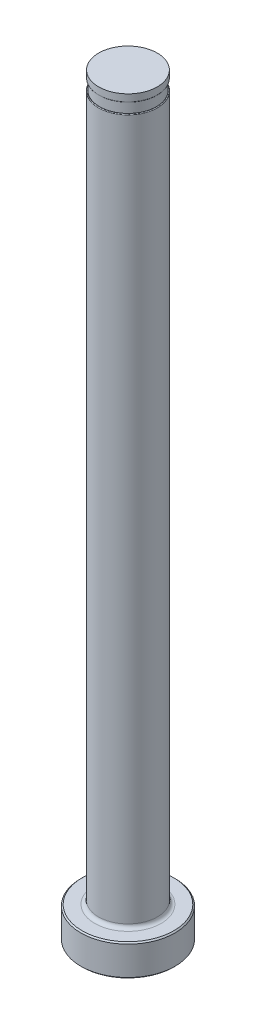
ISO-10303-21;
HEADER;
FILE_DESCRIPTION(('STEP AP214'),'2;1');
FILE_NAME('part.step','',(''),(''),'','','');
FILE_SCHEMA(('AUTOMOTIVE_DESIGN { 1 0 10303 214 1 1 1 1 }'));
ENDSEC;
DATA;
#1=APPLICATION_CONTEXT('core data for automotive mechanical design processes');
#2=APPLICATION_PROTOCOL_DEFINITION('international standard','automotive_design',2000,#1);
#3=PRODUCT_CONTEXT('',#1,'mechanical');
#4=PRODUCT('Part','Part','',(#3));
#5=PRODUCT_RELATED_PRODUCT_CATEGORY('part','',(#4));
#6=PRODUCT_DEFINITION_FORMATION('','',#4);
#7=PRODUCT_DEFINITION_CONTEXT('part definition',#1,'design');
#8=PRODUCT_DEFINITION('design','',#6,#7);
#9=PRODUCT_DEFINITION_SHAPE('','',#8);
#10=(LENGTH_UNIT() NAMED_UNIT(*) SI_UNIT(.MILLI.,.METRE.));
#11=(NAMED_UNIT(*) PLANE_ANGLE_UNIT() SI_UNIT($,.RADIAN.));
#12=(NAMED_UNIT(*) SI_UNIT($,.STERADIAN.) SOLID_ANGLE_UNIT());
#13=UNCERTAINTY_MEASURE_WITH_UNIT(LENGTH_MEASURE(1.E-05),#10,'distance_accuracy_value','');
#14=(GEOMETRIC_REPRESENTATION_CONTEXT(3) GLOBAL_UNCERTAINTY_ASSIGNED_CONTEXT((#13)) GLOBAL_UNIT_ASSIGNED_CONTEXT((#10,
#11,#12)) REPRESENTATION_CONTEXT('',''));
#15=CARTESIAN_POINT('',(0.,0.,0.));
#16=DIRECTION('',(0.,0.,1.));
#17=DIRECTION('',(1.,0.,0.));
#18=AXIS2_PLACEMENT_3D('',#15,#16,#17);
#19=CARTESIAN_POINT('',(-5.95248999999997,150.876,0.));
#20=DIRECTION('',(0.,1.,0.));
#21=DIRECTION('',(0.,0.,1.));
#22=AXIS2_PLACEMENT_3D('',#19,#20,#21);
#23=PLANE('',#22);
#24=CARTESIAN_POINT('',(0.,150.876,0.));
#25=DIRECTION('',(0.,1.,0.));
#26=DIRECTION('',(0.,0.,1.));
#27=AXIS2_PLACEMENT_3D('',#24,#25,#26);
#28=CIRCLE('',#27,5.80008999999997);
#29=CARTESIAN_POINT('',(0.,150.876,5.80008999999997));
#30=VERTEX_POINT('',#29);
#31=EDGE_CURVE('E11',#30,#30,#28,.F.);
#32=ORIENTED_EDGE('',*,*,#31,.T.);
#33=EDGE_LOOP('',(#32));
#34=FACE_BOUND('',#33,.T.);
#35=CARTESIAN_POINT('',(0.,150.876,0.));
#36=DIRECTION('',(0.,1.,0.));
#37=DIRECTION('',(0.,0.,1.));
#38=AXIS2_PLACEMENT_3D('',#35,#36,#37);
#39=CIRCLE('',#38,5.74928999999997);
#40=CARTESIAN_POINT('',(0.,150.876,5.74928999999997));
#41=VERTEX_POINT('',#40);
#42=EDGE_CURVE('E79',#41,#41,#39,.T.);
#43=ORIENTED_EDGE('',*,*,#42,.T.);
#44=EDGE_LOOP('',(#43));
#45=FACE_BOUND('',#44,.T.);
#46=ADVANCED_FACE('F37',(#34,#45),#23,.F.);
#47=CARTESIAN_POINT('',(0.,259.958771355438,0.));
#48=DIRECTION('',(0.,1.,0.));
#49=DIRECTION('',(0.,0.,1.));
#50=AXIS2_PLACEMENT_3D('',#47,#48,#49);
#51=CYLINDRICAL_SURFACE('',#50,5.95248999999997);
#52=DIRECTION('',(0.,1.,0.));
#53=VECTOR('',#52,1.);
#54=CARTESIAN_POINT('',(-5.74928999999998,259.958771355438,-1.5420122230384));
#55=LINE('',#54,#53);
#56=CARTESIAN_POINT('',(-5.74928999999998,148.717,-1.5420122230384));
#57=VERTEX_POINT('',#56);
#58=CARTESIAN_POINT('',(-5.74928999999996,86.36,-1.54201222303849));
#59=VERTEX_POINT('',#58);
#60=EDGE_CURVE('E74',#57,#59,#55,.F.);
#61=ORIENTED_EDGE('',*,*,#60,.F.);
#62=CARTESIAN_POINT('',(0.,148.717,0.));
#63=DIRECTION('',(0.,-1.,0.));
#64=DIRECTION('',(0.,0.,-1.));
#65=AXIS2_PLACEMENT_3D('',#62,#63,#64);
#66=CIRCLE('',#65,5.95248999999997);
#67=CARTESIAN_POINT('',(-5.74928999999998,148.717,1.5420122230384));
#68=VERTEX_POINT('',#67);
#69=EDGE_CURVE('E52',#57,#68,#66,.T.);
#70=ORIENTED_EDGE('',*,*,#69,.T.);
#71=DIRECTION('',(0.,1.,0.));
#72=VECTOR('',#71,1.);
#73=CARTESIAN_POINT('',(-5.74928999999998,259.958771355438,1.5420122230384));
#74=LINE('',#73,#72);
#75=CARTESIAN_POINT('',(-5.74928999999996,86.36,1.54201222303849));
#76=VERTEX_POINT('',#75);
#77=EDGE_CURVE('E85',#76,#68,#74,.T.);
#78=ORIENTED_EDGE('',*,*,#77,.F.);
#79=CARTESIAN_POINT('',(-5.74928999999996,86.36,-1.54201222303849));
#80=CARTESIAN_POINT('',(-5.7492869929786,86.3322208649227,-1.54201697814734));
#81=CARTESIAN_POINT('',(-5.74965505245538,86.3044610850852,-1.54065166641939));
#82=CARTESIAN_POINT('',(-5.75110274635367,86.2492460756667,-1.53524151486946));
#83=CARTESIAN_POINT('',(-5.75218176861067,86.2217906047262,-1.53119898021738));
#84=CARTESIAN_POINT('',(-5.75641075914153,86.1407767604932,-1.51525486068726));
#85=CARTESIAN_POINT('',(-5.76055400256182,86.0879793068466,-1.49953379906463));
#86=CARTESIAN_POINT('',(-5.77092696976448,85.9864513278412,-1.45909687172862));
#87=CARTESIAN_POINT('',(-5.77715061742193,85.937709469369,-1.43440718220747));
#88=CARTESIAN_POINT('',(-5.79098788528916,85.8449780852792,-1.37748193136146));
#89=CARTESIAN_POINT('',(-5.7986047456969,85.8010000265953,-1.34522872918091));
#90=CARTESIAN_POINT('',(-5.81685908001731,85.7061849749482,-1.26430278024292));
#91=CARTESIAN_POINT('',(-5.82772577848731,85.657138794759,-1.21359133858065));
#92=CARTESIAN_POINT('',(-5.84932001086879,85.5679814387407,-1.10484574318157));
#93=CARTESIAN_POINT('',(-5.86004729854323,85.5278844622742,-1.04680017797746));
#94=CARTESIAN_POINT('',(-5.88390059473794,85.4439339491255,-0.904778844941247));
#95=CARTESIAN_POINT('',(-5.89659263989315,85.4034837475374,-0.818723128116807));
#96=CARTESIAN_POINT('',(-5.91855552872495,85.3365666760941,-0.641010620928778));
#97=CARTESIAN_POINT('',(-5.92782357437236,85.3101112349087,-0.549349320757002));
#98=CARTESIAN_POINT('',(-5.94230780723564,85.2696429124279,-0.360889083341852));
#99=CARTESIAN_POINT('',(-5.94742894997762,85.2559208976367,-0.2640211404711));
#100=CARTESIAN_POINT('',(-5.95288793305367,85.241318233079,-0.0691558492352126));
#101=CARTESIAN_POINT('',(-5.95322242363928,85.2404465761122,0.0288422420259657));
#102=CARTESIAN_POINT('',(-5.94868446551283,85.2525404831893,0.242237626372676));
#103=CARTESIAN_POINT('',(-5.94283113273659,85.2681121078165,0.357477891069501));
#104=CARTESIAN_POINT('',(-5.92492015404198,85.3183022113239,0.583281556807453));
#105=CARTESIAN_POINT('',(-5.91286985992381,85.3528981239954,0.69385033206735));
#106=CARTESIAN_POINT('',(-5.88892429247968,85.4282489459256,0.870563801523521));
#107=CARTESIAN_POINT('',(-5.87828331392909,85.4632292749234,0.939352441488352));
#108=CARTESIAN_POINT('',(-5.85581507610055,85.5434071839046,1.07049428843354));
#109=CARTESIAN_POINT('',(-5.8439898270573,85.5885876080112,1.13285804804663));
#110=CARTESIAN_POINT('',(-5.82307219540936,85.6783208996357,1.2353431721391));
#111=CARTESIAN_POINT('',(-5.81396107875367,85.7207467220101,1.27731748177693));
#112=CARTESIAN_POINT('',(-5.79660025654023,85.8119777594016,1.35392068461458));
#113=CARTESIAN_POINT('',(-5.78834968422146,85.8607764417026,1.38855700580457));
#114=CARTESIAN_POINT('',(-5.77487399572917,85.9554137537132,1.44347959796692));
#115=CARTESIAN_POINT('',(-5.76937362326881,86.0003804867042,1.46519744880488));
#116=CARTESIAN_POINT('',(-5.76015985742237,86.0933997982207,1.50101335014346));
#117=CARTESIAN_POINT('',(-5.75644319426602,86.1414465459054,1.51512534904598));
#118=CARTESIAN_POINT('',(-5.75233279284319,86.2182424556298,1.53063311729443));
#119=CARTESIAN_POINT('',(-5.75119737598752,86.246400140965,1.53488770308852));
#120=CARTESIAN_POINT('',(-5.74967384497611,86.3030323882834,1.54058135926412));
#121=CARTESIAN_POINT('',(-5.74928611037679,86.3315071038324,1.54201899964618));
#122=CARTESIAN_POINT('',(-5.74928999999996,86.36,1.54201222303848));
#123=B_SPLINE_CURVE_WITH_KNOTS('',3,(#79,#80,#81,#82,#83,#84,#85,#86,#87,#88,#89,#90,#91,#92,
#93,#94,#95,#96,#97,#98,#99,#100,#101,#102,#103,#104,#105,#106,#107,#108,#109,#110,#111,#112,
#113,#114,#115,#116,#117,#118,#119,#120,#121,#122),.UNSPECIFIED.,.F.,.F.,(4,2,2,2,2,2,2,2,2,2,2,
2,2,2,2,2,2,2,2,2,2,4),(0.,0.083264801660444,0.166458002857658,0.331100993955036,
0.495267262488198,0.659820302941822,0.872804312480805,1.08612389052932,1.37238232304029,
1.65887416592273,1.95175985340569,2.24485049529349,2.59250114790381,2.939740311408,
3.17269488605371,3.40526052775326,3.58572381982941,3.7660035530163,3.91610532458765,
4.06593087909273,4.15129340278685,4.23669924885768),.UNSPECIFIED.);
#124=EDGE_CURVE('E82',#59,#76,#123,.T.);
#125=ORIENTED_EDGE('',*,*,#124,.F.);
#126=EDGE_LOOP('',(#61,#70,#78,#125));
#127=FACE_BOUND('',#126,.T.);
#128=CARTESIAN_POINT('',(0.,7.11200000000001,0.));
#129=DIRECTION('',(0.,1.,0.));
#130=DIRECTION('',(0.,0.,1.));
#131=AXIS2_PLACEMENT_3D('',#128,#129,#130);
#132=CIRCLE('',#131,5.95248999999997);
#133=CARTESIAN_POINT('',(0.,7.11200000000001,5.95248999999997));
#134=VERTEX_POINT('',#133);
#135=EDGE_CURVE('E117',#134,#134,#132,.T.);
#136=ORIENTED_EDGE('',*,*,#135,.T.);
#137=EDGE_LOOP('',(#136));
#138=FACE_BOUND('',#137,.T.);
#139=ADVANCED_FACE('F83',(#127,#138),#51,.T.);
#140=CARTESIAN_POINT('',(0.,0.,0.));
#141=DIRECTION('',(0.,-1.,0.));
#142=DIRECTION('',(0.,0.,-1.));
#143=AXIS2_PLACEMENT_3D('',#140,#141,#142);
#144=PLANE('',#143);
#145=CARTESIAN_POINT('',(0.,0.,0.));
#146=DIRECTION('',(0.,-1.,0.));
#147=DIRECTION('',(0.,0.,-1.));
#148=AXIS2_PLACEMENT_3D('',#145,#146,#147);
#149=CIRCLE('',#148,9.271);
#150=CARTESIAN_POINT('',(0.,0.,-9.271));
#151=VERTEX_POINT('',#150);
#152=EDGE_CURVE('E114',#151,#151,#149,.T.);
#153=ORIENTED_EDGE('',*,*,#152,.T.);
#154=EDGE_LOOP('',(#153));
#155=FACE_BOUND('',#154,.T.);
#156=ADVANCED_FACE('F193',(#155),#144,.T.);
#157=CARTESIAN_POINT('',(0.,259.958771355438,0.));
#158=DIRECTION('',(0.,1.,0.));
#159=DIRECTION('',(0.,0.,1.));
#160=AXIS2_PLACEMENT_3D('',#157,#158,#159);
#161=CYLINDRICAL_SURFACE('',#160,9.52499999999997);
#162=CARTESIAN_POINT('',(0.,6.09600000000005,0.));
#163=DIRECTION('',(0.,1.,0.));
#164=DIRECTION('',(0.,0.,1.));
#165=AXIS2_PLACEMENT_3D('',#162,#163,#164);
#166=CIRCLE('',#165,9.52499999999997);
#167=CARTESIAN_POINT('',(0.,6.09600000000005,9.52499999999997));
#168=VERTEX_POINT('',#167);
#169=EDGE_CURVE('E111',#168,#168,#166,.F.);
#170=ORIENTED_EDGE('',*,*,#169,.T.);
#171=EDGE_LOOP('',(#170));
#172=FACE_BOUND('',#171,.T.);
#173=CARTESIAN_POINT('',(0.,0.253999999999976,0.));
#174=DIRECTION('',(0.,-1.,0.));
#175=DIRECTION('',(0.,0.,-1.));
#176=AXIS2_PLACEMENT_3D('',#173,#174,#175);
#177=CIRCLE('',#176,9.52499999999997);
#178=CARTESIAN_POINT('',(0.,0.253999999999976,-9.52499999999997));
#179=VERTEX_POINT('',#178);
#180=EDGE_CURVE('E108',#179,#179,#177,.F.);
#181=ORIENTED_EDGE('',*,*,#180,.T.);
#182=EDGE_LOOP('',(#181));
#183=FACE_BOUND('',#182,.T.);
#184=ADVANCED_FACE('F196',(#172,#183),#161,.T.);
#185=CARTESIAN_POINT('',(-9.52499999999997,6.35,0.));
#186=DIRECTION('',(0.,1.,0.));
#187=DIRECTION('',(0.,0.,1.));
#188=AXIS2_PLACEMENT_3D('',#185,#186,#187);
#189=PLANE('',#188);
#190=CARTESIAN_POINT('',(0.,6.35,0.));
#191=DIRECTION('',(0.,1.,0.));
#192=DIRECTION('',(0.,0.,1.));
#193=AXIS2_PLACEMENT_3D('',#190,#191,#192);
#194=CIRCLE('',#193,6.71448999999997);
#195=CARTESIAN_POINT('',(0.,6.35,6.71448999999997));
#196=VERTEX_POINT('',#195);
#197=EDGE_CURVE('E88',#196,#196,#194,.F.);
#198=ORIENTED_EDGE('',*,*,#197,.T.);
#199=EDGE_LOOP('',(#198));
#200=FACE_BOUND('',#199,.T.);
#201=CARTESIAN_POINT('',(0.,6.35,0.));
#202=DIRECTION('',(0.,1.,0.));
#203=DIRECTION('',(0.,0.,1.));
#204=AXIS2_PLACEMENT_3D('',#201,#202,#203);
#205=CIRCLE('',#204,9.27100000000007);
#206=CARTESIAN_POINT('',(0.,6.35,9.27100000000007));
#207=VERTEX_POINT('',#206);
#208=EDGE_CURVE('E105',#207,#207,#205,.T.);
#209=ORIENTED_EDGE('',*,*,#208,.T.);
#210=EDGE_LOOP('',(#209));
#211=FACE_BOUND('',#210,.T.);
#212=ADVANCED_FACE('F191',(#200,#211),#189,.T.);
#213=CARTESIAN_POINT('',(0.,6.35000000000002,0.));
#214=DIRECTION('',(0.,-1.,0.));
#215=DIRECTION('',(0.,0.,-1.));
#216=AXIS2_PLACEMENT_3D('',#213,#214,#215);
#217=CONICAL_SURFACE('',#216,9.27100000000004,0.785398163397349);
#218=ORIENTED_EDGE('',*,*,#169,.F.);
#219=EDGE_LOOP('',(#218));
#220=FACE_BOUND('',#219,.T.);
#221=ORIENTED_EDGE('',*,*,#208,.F.);
#222=EDGE_LOOP('',(#221));
#223=FACE_BOUND('',#222,.T.);
#224=ADVANCED_FACE('F187',(#220,#223),#217,.T.);
#225=CARTESIAN_POINT('',(0.,0.253999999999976,0.));
#226=DIRECTION('',(0.,1.,0.));
#227=DIRECTION('',(0.,0.,1.));
#228=AXIS2_PLACEMENT_3D('',#225,#226,#227);
#229=CONICAL_SURFACE('',#228,9.52499999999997,0.785398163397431);
#230=ORIENTED_EDGE('',*,*,#152,.F.);
#231=EDGE_LOOP('',(#230));
#232=FACE_BOUND('',#231,.T.);
#233=ORIENTED_EDGE('',*,*,#180,.F.);
#234=EDGE_LOOP('',(#233));
#235=FACE_BOUND('',#234,.T.);
#236=ADVANCED_FACE('F183',(#232,#235),#229,.T.);
#237=CARTESIAN_POINT('',(0.,7.11200000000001,0.));
#238=DIRECTION('',(0.,1.,0.));
#239=DIRECTION('',(0.,0.,1.));
#240=AXIS2_PLACEMENT_3D('',#237,#238,#239);
#241=TOROIDAL_SURFACE('',#240,6.71448999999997,0.762);
#242=ORIENTED_EDGE('',*,*,#197,.F.);
#243=EDGE_LOOP('',(#242));
#244=FACE_BOUND('',#243,.T.);
#245=ORIENTED_EDGE('',*,*,#135,.F.);
#246=EDGE_LOOP('',(#245));
#247=FACE_BOUND('',#246,.T.);
#248=ADVANCED_FACE('F148',(#244,#247),#241,.F.);
#249=CARTESIAN_POINT('',(-5.95248999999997,148.844,0.));
#250=DIRECTION('',(0.,-1.,0.));
#251=DIRECTION('',(0.,0.,-1.));
#252=AXIS2_PLACEMENT_3D('',#249,#250,#251);
#253=PLANE('',#252);
#254=DIRECTION('',(0.,0.,1.));
#255=VECTOR('',#254,1.);
#256=CARTESIAN_POINT('',(-5.74928999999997,148.844,0.));
#257=LINE('',#256,#255);
#258=CARTESIAN_POINT('',(-5.74928999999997,148.844,0.));
#259=VERTEX_POINT('',#258);
#260=CARTESIAN_POINT('',(-5.74928999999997,148.844,0.939147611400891));
#261=VERTEX_POINT('',#260);
#262=EDGE_CURVE('E91',#259,#261,#257,.T.);
#263=ORIENTED_EDGE('',*,*,#262,.T.);
#264=CARTESIAN_POINT('',(0.,148.844,0.));
#265=DIRECTION('',(0.,-1.,0.));
#266=DIRECTION('',(0.,0.,-1.));
#267=AXIS2_PLACEMENT_3D('',#264,#265,#266);
#268=CIRCLE('',#267,5.82548999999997);
#269=CARTESIAN_POINT('',(-5.74928999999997,148.844,-0.939147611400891));
#270=VERTEX_POINT('',#269);
#271=EDGE_CURVE('E87',#261,#270,#268,.F.);
#272=ORIENTED_EDGE('',*,*,#271,.T.);
#273=EDGE_CURVE('E80',#270,#259,#257,.T.);
#274=ORIENTED_EDGE('',*,*,#273,.T.);
#275=CARTESIAN_POINT('',(0.,148.844,0.));
#276=DIRECTION('',(0.,1.,0.));
#277=DIRECTION('',(0.,0.,1.));
#278=AXIS2_PLACEMENT_3D('',#275,#276,#277);
#279=CIRCLE('',#278,5.74928999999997);
#280=EDGE_CURVE('E102',#259,#259,#279,.T.);
#281=ORIENTED_EDGE('',*,*,#280,.F.);
#282=EDGE_LOOP('',(#263,#272,#274,#281));
#283=FACE_BOUND('',#282,.T.);
#284=ADVANCED_FACE('F145',(#283),#253,.F.);
#285=CARTESIAN_POINT('',(0.,153.448281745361,0.));
#286=DIRECTION('',(0.,1.,0.));
#287=DIRECTION('',(0.,0.,1.));
#288=AXIS2_PLACEMENT_3D('',#285,#286,#287);
#289=CYLINDRICAL_SURFACE('',#288,5.74928999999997);
#290=ORIENTED_EDGE('',*,*,#42,.F.);
#291=EDGE_LOOP('',(#290));
#292=FACE_BOUND('',#291,.T.);
#293=ORIENTED_EDGE('',*,*,#280,.T.);
#294=EDGE_LOOP('',(#293));
#295=FACE_BOUND('',#294,.T.);
#296=ADVANCED_FACE('F142',(#292,#295),#289,.T.);
#297=CARTESIAN_POINT('',(-5.74928999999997,149.86,-9.52499999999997));
#298=DIRECTION('',(1.,0.,0.));
#299=DIRECTION('',(0.,1.,0.));
#300=AXIS2_PLACEMENT_3D('',#297,#298,#299);
#301=PLANE('',#300);
#302=ORIENTED_EDGE('',*,*,#273,.F.);
#303=CARTESIAN_POINT('',(-5.74928999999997,148.844,-0.939147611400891));
#304=CARTESIAN_POINT('',(-5.74928999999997,148.843999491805,-0.960313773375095));
#305=CARTESIAN_POINT('',(-5.74928999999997,148.843863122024,-0.981479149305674));
#306=CARTESIAN_POINT('',(-5.74928999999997,148.843255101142,-1.02381131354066));
#307=CARTESIAN_POINT('',(-5.74928999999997,148.842783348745,-1.0449781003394));
#308=CARTESIAN_POINT('',(-5.74928999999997,148.840768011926,-1.10851964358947));
#309=CARTESIAN_POINT('',(-5.74928999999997,148.838624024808,-1.15088175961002));
#310=CARTESIAN_POINT('',(-5.74928999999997,148.833688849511,-1.21286687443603));
#311=CARTESIAN_POINT('',(-5.74928999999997,148.831853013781,-1.23256518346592));
#312=CARTESIAN_POINT('',(-5.74928999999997,148.827501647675,-1.27188290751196));
#313=CARTESIAN_POINT('',(-5.74928999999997,148.824986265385,-1.2915023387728));
#314=CARTESIAN_POINT('',(-5.74928999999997,148.817966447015,-1.33801228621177));
#315=CARTESIAN_POINT('',(-5.74928999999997,148.813069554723,-1.36484781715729));
#316=CARTESIAN_POINT('',(-5.74928999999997,148.802495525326,-1.40986464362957));
#317=CARTESIAN_POINT('',(-5.74928999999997,148.797508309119,-1.42819643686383));
#318=CARTESIAN_POINT('',(-5.74928999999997,148.788514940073,-1.45484549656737));
#319=CARTESIAN_POINT('',(-5.74928999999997,148.785335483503,-1.46343850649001));
#320=CARTESIAN_POINT('',(-5.74928999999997,148.77827591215,-1.48034059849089));
#321=CARTESIAN_POINT('',(-5.74928999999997,148.774396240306,-1.48864985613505));
#322=CARTESIAN_POINT('',(-5.74928999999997,148.767506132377,-1.50120056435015));
#323=CARTESIAN_POINT('',(-5.74928999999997,148.764853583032,-1.50563682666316));
#324=CARTESIAN_POINT('',(-5.74928999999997,148.759101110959,-1.51421595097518));
#325=CARTESIAN_POINT('',(-5.74928999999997,148.75600162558,-1.51835909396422));
#326=CARTESIAN_POINT('',(-5.74928999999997,148.750471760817,-1.52466635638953));
#327=CARTESIAN_POINT('',(-5.74928999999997,148.74822570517,-1.52699040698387));
#328=CARTESIAN_POINT('',(-5.74928999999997,148.743445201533,-1.53132640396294));
#329=CARTESIAN_POINT('',(-5.74928999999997,148.740911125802,-1.53333874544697));
#330=CARTESIAN_POINT('',(-5.74928999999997,148.736334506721,-1.53634422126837));
#331=CARTESIAN_POINT('',(-5.74928999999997,148.734374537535,-1.53746164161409));
#332=CARTESIAN_POINT('',(-5.74928999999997,148.730307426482,-1.53937528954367));
#333=CARTESIAN_POINT('',(-5.74928999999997,148.728200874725,-1.54017272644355));
#334=CARTESIAN_POINT('',(-5.74928999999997,148.7245728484,-1.54117250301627));
#335=CARTESIAN_POINT('',(-5.74928999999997,148.723081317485,-1.54148377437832));
#336=CARTESIAN_POINT('',(-5.74928999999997,148.720060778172,-1.54190531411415));
#337=CARTESIAN_POINT('',(-5.74928999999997,148.718531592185,-1.54201429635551));
#338=CARTESIAN_POINT('',(-5.74928999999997,148.717000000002,-1.54201222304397));
#339=B_SPLINE_CURVE_WITH_KNOTS('',3,(#303,#304,#305,#306,#307,#308,#309,#310,#311,#312,#313,
#314,#315,#316,#317,#318,#319,#320,#321,#322,#323,#324,#325,#326,#327,#328,#329,#330,#331,#332,
#333,#334,#335,#336,#337,#338),.UNSPECIFIED.,.F.,.F.,(4,2,2,2,2,2,2,2,2,2,2,2,2,2,2,2,2,4),(0.,
0.0634959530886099,0.127011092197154,0.254202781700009,0.313544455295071,0.372873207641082,
0.45462942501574,0.511527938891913,0.538997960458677,0.566450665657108,0.581940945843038,
0.597416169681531,0.607094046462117,0.616759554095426,0.623507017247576,0.630228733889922,
0.634786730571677,0.639373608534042),.UNSPECIFIED.);
#340=EDGE_CURVE('E60',#270,#57,#339,.T.);
#341=ORIENTED_EDGE('',*,*,#340,.T.);
#342=ORIENTED_EDGE('',*,*,#60,.T.);
#343=DIRECTION('',(0.,0.,1.));
#344=VECTOR('',#343,1.);
#345=CARTESIAN_POINT('',(-5.74928999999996,86.36,-9.52499999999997));
#346=LINE('',#345,#344);
#347=EDGE_CURVE('E78',#59,#76,#346,.T.);
#348=ORIENTED_EDGE('',*,*,#347,.T.);
#349=ORIENTED_EDGE('',*,*,#77,.T.);
#350=CARTESIAN_POINT('',(-5.74928999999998,148.717,1.5420122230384));
#351=CARTESIAN_POINT('',(-5.74928999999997,148.719261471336,1.54202038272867));
#352=CARTESIAN_POINT('',(-5.74928999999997,148.721510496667,1.54177946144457));
#353=CARTESIAN_POINT('',(-5.74928999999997,148.725887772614,1.54087970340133));
#354=CARTESIAN_POINT('',(-5.74928999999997,148.728017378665,1.54022760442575));
#355=CARTESIAN_POINT('',(-5.74928999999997,148.732617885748,1.53838865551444));
#356=CARTESIAN_POINT('',(-5.74928999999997,148.735052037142,1.53711237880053));
#357=CARTESIAN_POINT('',(-5.74928999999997,148.739698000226,1.53418694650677));
#358=CARTESIAN_POINT('',(-5.74928999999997,148.741908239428,1.53253538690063));
#359=CARTESIAN_POINT('',(-5.74928999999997,148.747730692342,1.52761233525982));
#360=CARTESIAN_POINT('',(-5.74928999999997,148.751112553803,1.52407243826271));
#361=CARTESIAN_POINT('',(-5.74928999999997,148.757360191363,1.51657566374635));
#362=CARTESIAN_POINT('',(-5.74928999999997,148.76022496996,1.51261800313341));
#363=CARTESIAN_POINT('',(-5.74928999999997,148.767008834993,1.50226117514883));
#364=CARTESIAN_POINT('',(-5.74928999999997,148.770667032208,1.49569302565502));
#365=CARTESIAN_POINT('',(-5.74928999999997,148.777372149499,1.48224724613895));
#366=CARTESIAN_POINT('',(-5.74928999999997,148.780417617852,1.47536892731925));
#367=CARTESIAN_POINT('',(-5.74928999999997,148.788912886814,1.45440029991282));
#368=CARTESIAN_POINT('',(-5.74928999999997,148.793686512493,1.44003865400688));
#369=CARTESIAN_POINT('',(-5.74928999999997,148.802114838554,1.41106200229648));
#370=CARTESIAN_POINT('',(-5.74928999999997,148.805772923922,1.39644790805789));
#371=CARTESIAN_POINT('',(-5.74928999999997,148.812305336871,1.36704254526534));
#372=CARTESIAN_POINT('',(-5.74928999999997,148.815179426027,1.35225122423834));
#373=CARTESIAN_POINT('',(-5.74928999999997,148.822936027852,1.30765909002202));
#374=CARTESIAN_POINT('',(-5.74928999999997,148.826935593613,1.27770752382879));
#375=CARTESIAN_POINT('',(-5.74928999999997,148.833413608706,1.21764271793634));
#376=CARTESIAN_POINT('',(-5.74928999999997,148.835891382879,1.18752941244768));
#377=CARTESIAN_POINT('',(-5.74928999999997,148.83974393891,1.12726865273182));
#378=CARTESIAN_POINT('',(-5.74928999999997,148.841119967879,1.09712127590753));
#379=CARTESIAN_POINT('',(-5.74928999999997,148.842769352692,1.04562383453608));
#380=CARTESIAN_POINT('',(-5.74928999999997,148.843247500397,1.02427949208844));
#381=CARTESIAN_POINT('',(-5.74928999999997,148.843861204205,0.981672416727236));
#382=CARTESIAN_POINT('',(-5.74928999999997,148.843998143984,0.960409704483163));
#383=CARTESIAN_POINT('',(-5.74928999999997,148.844,0.939147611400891));
#384=B_SPLINE_CURVE_WITH_KNOTS('',3,(#350,#351,#352,#353,#354,#355,#356,#357,#358,#359,#360,
#361,#362,#363,#364,#365,#366,#367,#368,#369,#370,#371,#372,#373,#374,#375,#376,#377,#378,#379,
#380,#381,#382,#383),.UNSPECIFIED.,.F.,.F.,(4,2,2,2,2,2,2,2,2,2,2,2,2,2,2,2,4),(0.,
0.00675172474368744,0.0133955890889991,0.0215941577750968,0.0298468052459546,0.0444516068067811,
0.0590842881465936,0.0815815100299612,0.104131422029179,0.149443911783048,0.194617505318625,
0.239804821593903,0.330387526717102,0.421010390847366,0.511530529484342,0.575577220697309,
0.639363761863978),.UNSPECIFIED.);
#385=EDGE_CURVE('E173',#68,#261,#384,.T.);
#386=ORIENTED_EDGE('',*,*,#385,.T.);
#387=ORIENTED_EDGE('',*,*,#262,.F.);
#388=EDGE_LOOP('',(#302,#341,#342,#348,#349,#386,#387));
#389=FACE_BOUND('',#388,.T.);
#390=ADVANCED_FACE('F76',(#389),#301,.F.);
#391=CARTESIAN_POINT('',(-8.92428999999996,86.36,-9.52499999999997));
#392=DIRECTION('',(0.,0.,1.));
#393=DIRECTION('',(1.,0.,0.));
#394=AXIS2_PLACEMENT_3D('',#391,#392,#393);
#395=CYLINDRICAL_SURFACE('',#394,3.175);
#396=ORIENTED_EDGE('',*,*,#347,.F.);
#397=ORIENTED_EDGE('',*,*,#124,.T.);
#398=EDGE_LOOP('',(#396,#397));
#399=FACE_BOUND('',#398,.T.);
#400=ADVANCED_FACE('F90',(#399),#395,.F.);
#401=CARTESIAN_POINT('',(0.,152.687735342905,0.));
#402=DIRECTION('',(0.,1.,0.));
#403=DIRECTION('',(0.,0.,1.));
#404=AXIS2_PLACEMENT_3D('',#401,#402,#403);
#405=CYLINDRICAL_SURFACE('',#404,5.92708999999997);
#406=CARTESIAN_POINT('',(0.,151.003,0.));
#407=DIRECTION('',(0.,1.,0.));
#408=DIRECTION('',(0.,0.,1.));
#409=AXIS2_PLACEMENT_3D('',#406,#407,#408);
#410=CIRCLE('',#409,5.92708999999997);
#411=CARTESIAN_POINT('',(0.,151.003,5.92708999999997));
#412=VERTEX_POINT('',#411);
#413=EDGE_CURVE('E45',#412,#412,#410,.T.);
#414=ORIENTED_EDGE('',*,*,#413,.T.);
#415=EDGE_LOOP('',(#414));
#416=FACE_BOUND('',#415,.T.);
#417=CARTESIAN_POINT('',(0.,152.4,0.));
#418=DIRECTION('',(0.,1.,0.));
#419=DIRECTION('',(0.,0.,1.));
#420=AXIS2_PLACEMENT_3D('',#417,#418,#419);
#421=CIRCLE('',#420,5.92708999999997);
#422=CARTESIAN_POINT('',(0.,152.4,5.92708999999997));
#423=VERTEX_POINT('',#422);
#424=EDGE_CURVE('E92',#423,#423,#421,.T.);
#425=ORIENTED_EDGE('',*,*,#424,.F.);
#426=EDGE_LOOP('',(#425));
#427=FACE_BOUND('',#426,.T.);
#428=ADVANCED_FACE('F136',(#416,#427),#405,.T.);
#429=CARTESIAN_POINT('',(-5.95248999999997,152.4,0.));
#430=DIRECTION('',(0.,1.,0.));
#431=DIRECTION('',(0.,0.,1.));
#432=AXIS2_PLACEMENT_3D('',#429,#430,#431);
#433=PLANE('',#432);
#434=ORIENTED_EDGE('',*,*,#424,.T.);
#435=EDGE_LOOP('',(#434));
#436=FACE_BOUND('',#435,.T.);
#437=ADVANCED_FACE('F150',(#436),#433,.T.);
#438=CARTESIAN_POINT('',(0.,148.717,0.));
#439=DIRECTION('',(0.,-1.,0.));
#440=DIRECTION('',(0.,0.,-1.));
#441=AXIS2_PLACEMENT_3D('',#438,#439,#440);
#442=TOROIDAL_SURFACE('',#441,5.82548999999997,0.127);
#443=ORIENTED_EDGE('',*,*,#385,.F.);
#444=ORIENTED_EDGE('',*,*,#69,.F.);
#445=ORIENTED_EDGE('',*,*,#340,.F.);
#446=ORIENTED_EDGE('',*,*,#271,.F.);
#447=EDGE_LOOP('',(#443,#444,#445,#446));
#448=FACE_BOUND('',#447,.T.);
#449=ADVANCED_FACE('F152',(#448),#442,.T.);
#450=CARTESIAN_POINT('',(0.,151.003,0.));
#451=DIRECTION('',(0.,1.,0.));
#452=DIRECTION('',(0.,0.,1.));
#453=AXIS2_PLACEMENT_3D('',#450,#451,#452);
#454=TOROIDAL_SURFACE('',#453,5.80008999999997,0.127);
#455=ORIENTED_EDGE('',*,*,#31,.F.);
#456=EDGE_LOOP('',(#455));
#457=FACE_BOUND('',#456,.T.);
#458=ORIENTED_EDGE('',*,*,#413,.F.);
#459=EDGE_LOOP('',(#458));
#460=FACE_BOUND('',#459,.T.);
#461=ADVANCED_FACE('F39',(#457,#460),#454,.T.);
#462=CLOSED_SHELL('',(#46,#139,#156,#184,#212,#224,#236,#248,#284,#296,#390,#400,#428,#437,#449,#461));
#463=MANIFOLD_SOLID_BREP('B2',#462);
#464=ADVANCED_BREP_SHAPE_REPRESENTATION('',(#18,#463),#14);
#465=SHAPE_DEFINITION_REPRESENTATION(#9,#464);
ENDSEC;
END-ISO-10303-21;
